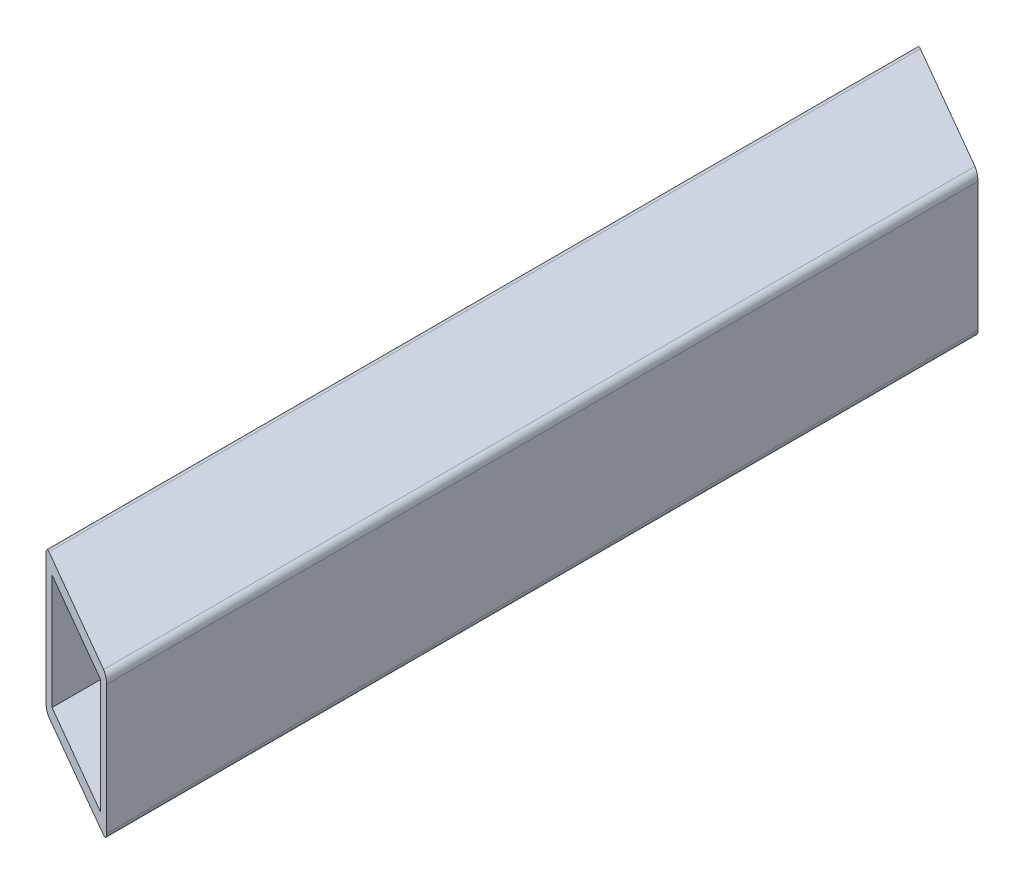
ISO-10303-21;
HEADER;
FILE_DESCRIPTION(('STEP AP214'),'2;1');
FILE_NAME('part.step','',(''),(''),'','','');
FILE_SCHEMA(('AUTOMOTIVE_DESIGN { 1 0 10303 214 1 1 1 1 }'));
ENDSEC;
DATA;
#1=APPLICATION_CONTEXT('core data for automotive mechanical design processes');
#2=APPLICATION_PROTOCOL_DEFINITION('international standard','automotive_design',2000,#1);
#3=PRODUCT_CONTEXT('',#1,'mechanical');
#4=PRODUCT('Part','Part','',(#3));
#5=PRODUCT_RELATED_PRODUCT_CATEGORY('part','',(#4));
#6=PRODUCT_DEFINITION_FORMATION('','',#4);
#7=PRODUCT_DEFINITION_CONTEXT('part definition',#1,'design');
#8=PRODUCT_DEFINITION('design','',#6,#7);
#9=PRODUCT_DEFINITION_SHAPE('','',#8);
#10=(LENGTH_UNIT() NAMED_UNIT(*) SI_UNIT(.MILLI.,.METRE.));
#11=(NAMED_UNIT(*) PLANE_ANGLE_UNIT() SI_UNIT($,.RADIAN.));
#12=(NAMED_UNIT(*) SI_UNIT($,.STERADIAN.) SOLID_ANGLE_UNIT());
#13=UNCERTAINTY_MEASURE_WITH_UNIT(LENGTH_MEASURE(1.E-05),#10,'distance_accuracy_value','');
#14=(GEOMETRIC_REPRESENTATION_CONTEXT(3) GLOBAL_UNCERTAINTY_ASSIGNED_CONTEXT((#13)) GLOBAL_UNIT_ASSIGNED_CONTEXT((#10,
#11,#12)) REPRESENTATION_CONTEXT('',''));
#15=CARTESIAN_POINT('',(0.,0.,0.));
#16=DIRECTION('',(0.,0.,1.));
#17=DIRECTION('',(1.,0.,0.));
#18=AXIS2_PLACEMENT_3D('',#15,#16,#17);
#19=CARTESIAN_POINT('',(-9.,8.,133.));
#20=DIRECTION('',(0.,1.,0.));
#21=DIRECTION('',(0.,0.,1.));
#22=AXIS2_PLACEMENT_3D('',#19,#20,#21);
#23=PLANE('',#22);
#24=DIRECTION('',(0.,0.,-1.));
#25=VECTOR('',#24,1.);
#26=CARTESIAN_POINT('',(8.,8.,133.));
#27=LINE('',#26,#25);
#28=CARTESIAN_POINT('',(8.,8.,131.845299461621));
#29=VERTEX_POINT('',#28);
#30=CARTESIAN_POINT('',(8.,8.,10.3923048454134));
#31=VERTEX_POINT('',#30);
#32=EDGE_CURVE('E210',#29,#31,#27,.T.);
#33=ORIENTED_EDGE('',*,*,#32,.F.);
#34=DIRECTION('',(-0.86602540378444,0.,-0.499999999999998));
#35=VECTOR('',#34,1.);
#36=CARTESIAN_POINT('',(-4.25000000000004,8.,124.772758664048));
#37=LINE('',#36,#35);
#38=CARTESIAN_POINT('',(-8.,8.,122.607695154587));
#39=VERTEX_POINT('',#38);
#40=EDGE_CURVE('E11',#29,#39,#37,.T.);
#41=ORIENTED_EDGE('',*,*,#40,.T.);
#42=DIRECTION('',(0.,0.,-1.));
#43=VECTOR('',#42,1.);
#44=CARTESIAN_POINT('',(-8.,8.,133.));
#45=LINE('',#44,#43);
#46=CARTESIAN_POINT('',(-8.,8.,1.15470053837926));
#47=VERTEX_POINT('',#46);
#48=EDGE_CURVE('E208',#39,#47,#45,.T.);
#49=ORIENTED_EDGE('',*,*,#48,.T.);
#50=DIRECTION('',(0.866025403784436,0.,0.500000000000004));
#51=VECTOR('',#50,1.);
#52=CARTESIAN_POINT('',(48.3406893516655,8.,33.6830127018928));
#53=LINE('',#52,#51);
#54=EDGE_CURVE('E38',#47,#31,#53,.T.);
#55=ORIENTED_EDGE('',*,*,#54,.T.);
#56=EDGE_LOOP('',(#33,#41,#49,#55));
#57=FACE_BOUND('',#56,.T.);
#58=ADVANCED_FACE('F30',(#57),#23,.F.);
#59=CARTESIAN_POINT('',(8.,-9.,133.));
#60=DIRECTION('',(-1.,0.,0.));
#61=DIRECTION('',(0.,-1.,0.));
#62=AXIS2_PLACEMENT_3D('',#59,#60,#61);
#63=PLANE('',#62);
#64=DIRECTION('',(0.,-1.,0.));
#65=VECTOR('',#64,1.);
#66=CARTESIAN_POINT('',(8.,-9.,131.845299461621));
#67=LINE('',#66,#65);
#68=CARTESIAN_POINT('',(8.,-8.,131.845299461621));
#69=VERTEX_POINT('',#68);
#70=EDGE_CURVE('E190',#29,#69,#67,.T.);
#71=ORIENTED_EDGE('',*,*,#70,.F.);
#72=ORIENTED_EDGE('',*,*,#32,.T.);
#73=DIRECTION('',(0.,1.,0.));
#74=VECTOR('',#73,1.);
#75=CARTESIAN_POINT('',(8.,-9.00000000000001,10.3923048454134));
#76=LINE('',#75,#74);
#77=CARTESIAN_POINT('',(8.,-8.,10.3923048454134));
#78=VERTEX_POINT('',#77);
#79=EDGE_CURVE('E227',#78,#31,#76,.T.);
#80=ORIENTED_EDGE('',*,*,#79,.F.);
#81=DIRECTION('',(0.,0.,-1.));
#82=VECTOR('',#81,1.);
#83=CARTESIAN_POINT('',(8.,-8.,133.));
#84=LINE('',#83,#82);
#85=EDGE_CURVE('E212',#69,#78,#84,.T.);
#86=ORIENTED_EDGE('',*,*,#85,.F.);
#87=EDGE_LOOP('',(#71,#72,#80,#86));
#88=FACE_BOUND('',#87,.T.);
#89=ADVANCED_FACE('F244',(#88),#63,.T.);
#90=CARTESIAN_POINT('',(-9.,-8.,133.));
#91=DIRECTION('',(0.,-1.,0.));
#92=DIRECTION('',(0.,0.,-1.));
#93=AXIS2_PLACEMENT_3D('',#90,#91,#92);
#94=PLANE('',#93);
#95=DIRECTION('',(0.,0.,-1.));
#96=VECTOR('',#95,1.);
#97=CARTESIAN_POINT('',(-8.,-8.,133.));
#98=LINE('',#97,#96);
#99=CARTESIAN_POINT('',(-8.,-8.,122.607695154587));
#100=VERTEX_POINT('',#99);
#101=CARTESIAN_POINT('',(-8.,-8.,1.15470053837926));
#102=VERTEX_POINT('',#101);
#103=EDGE_CURVE('E215',#100,#102,#98,.T.);
#104=ORIENTED_EDGE('',*,*,#103,.F.);
#105=DIRECTION('',(0.86602540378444,0.,0.499999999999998));
#106=VECTOR('',#105,1.);
#107=CARTESIAN_POINT('',(-4.25000000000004,-8.,124.772758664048));
#108=LINE('',#107,#106);
#109=EDGE_CURVE('E196',#100,#69,#108,.T.);
#110=ORIENTED_EDGE('',*,*,#109,.T.);
#111=ORIENTED_EDGE('',*,*,#85,.T.);
#112=DIRECTION('',(-0.866025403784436,0.,-0.500000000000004));
#113=VECTOR('',#112,1.);
#114=CARTESIAN_POINT('',(48.3406893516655,-8.,33.6830127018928));
#115=LINE('',#114,#113);
#116=EDGE_CURVE('E229',#78,#102,#115,.T.);
#117=ORIENTED_EDGE('',*,*,#116,.T.);
#118=EDGE_LOOP('',(#104,#110,#111,#117));
#119=FACE_BOUND('',#118,.T.);
#120=ADVANCED_FACE('F249',(#119),#94,.F.);
#121=CARTESIAN_POINT('',(-8.,-9.,133.));
#122=DIRECTION('',(1.,0.,0.));
#123=DIRECTION('',(0.,1.,0.));
#124=AXIS2_PLACEMENT_3D('',#121,#122,#123);
#125=PLANE('',#124);
#126=DIRECTION('',(0.,1.,0.));
#127=VECTOR('',#126,1.);
#128=CARTESIAN_POINT('',(-8.,-9.,122.607695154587));
#129=LINE('',#128,#127);
#130=EDGE_CURVE('E53',#100,#39,#129,.T.);
#131=ORIENTED_EDGE('',*,*,#130,.F.);
#132=ORIENTED_EDGE('',*,*,#103,.T.);
#133=DIRECTION('',(0.,-1.,0.));
#134=VECTOR('',#133,1.);
#135=CARTESIAN_POINT('',(-8.,-8.99999999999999,1.15470053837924));
#136=LINE('',#135,#134);
#137=EDGE_CURVE('E130',#47,#102,#136,.T.);
#138=ORIENTED_EDGE('',*,*,#137,.F.);
#139=ORIENTED_EDGE('',*,*,#48,.F.);
#140=EDGE_LOOP('',(#131,#132,#138,#139));
#141=FACE_BOUND('',#140,.T.);
#142=ADVANCED_FACE('F257',(#141),#125,.T.);
#143=CARTESIAN_POINT('',(-23.8618890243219,-10.,-8.00316535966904));
#144=DIRECTION('',(-0.500000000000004,0.,0.866025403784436));
#145=DIRECTION('',(0.866025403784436,0.,0.500000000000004));
#146=AXIS2_PLACEMENT_3D('',#143,#144,#145);
#147=PLANE('',#146);
#148=CARTESIAN_POINT('',(9.,-9.,10.969655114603));
#149=DIRECTION('',(-0.500000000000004,0.,0.866025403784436));
#150=DIRECTION('',(-0.866025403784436,0.,-0.500000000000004));
#151=AXIS2_PLACEMENT_3D('',#148,#149,#150);
#152=ELLIPSE('',#151,1.15470053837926,1.);
#153=CARTESIAN_POINT('',(10.,-9.,11.5470053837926));
#154=VERTEX_POINT('',#153);
#155=CARTESIAN_POINT('',(8.99999999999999,-10.,10.969655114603));
#156=VERTEX_POINT('',#155);
#157=EDGE_CURVE('E188',#154,#156,#152,.F.);
#158=ORIENTED_EDGE('',*,*,#157,.T.);
#159=DIRECTION('',(0.866025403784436,0.,0.500000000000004));
#160=VECTOR('',#159,1.);
#161=CARTESIAN_POINT('',(-23.8618890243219,-10.,-8.00316535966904));
#162=LINE('',#161,#160);
#163=CARTESIAN_POINT('',(-9.,-10.,0.57735026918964));
#164=VERTEX_POINT('',#163);
#165=EDGE_CURVE('E224',#164,#156,#162,.T.);
#166=ORIENTED_EDGE('',*,*,#165,.F.);
#167=CARTESIAN_POINT('',(-9.,-9.,0.577350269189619));
#168=DIRECTION('',(-0.500000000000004,0.,0.866025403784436));
#169=DIRECTION('',(-0.866025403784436,0.,-0.500000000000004));
#170=AXIS2_PLACEMENT_3D('',#167,#168,#169);
#171=ELLIPSE('',#170,1.15470053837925,0.999999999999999);
#172=CARTESIAN_POINT('',(-10.,-9.,0.));
#173=VERTEX_POINT('',#172);
#174=EDGE_CURVE('E129',#164,#173,#171,.F.);
#175=ORIENTED_EDGE('',*,*,#174,.T.);
#176=DIRECTION('',(0.,-1.,0.));
#177=VECTOR('',#176,1.);
#178=CARTESIAN_POINT('',(-10.,9.,0.));
#179=LINE('',#178,#177);
#180=CARTESIAN_POINT('',(-10.,9.,0.));
#181=VERTEX_POINT('',#180);
#182=EDGE_CURVE('E124',#181,#173,#179,.T.);
#183=ORIENTED_EDGE('',*,*,#182,.F.);
#184=CARTESIAN_POINT('',(-9.,9.,0.577350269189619));
#185=DIRECTION('',(-0.500000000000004,0.,0.866025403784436));
#186=DIRECTION('',(-0.866025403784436,0.,-0.500000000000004));
#187=AXIS2_PLACEMENT_3D('',#184,#185,#186);
#188=ELLIPSE('',#187,1.15470053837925,0.999999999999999);
#189=CARTESIAN_POINT('',(-9.,10.,0.57735026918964));
#190=VERTEX_POINT('',#189);
#191=EDGE_CURVE('E117',#181,#190,#188,.F.);
#192=ORIENTED_EDGE('',*,*,#191,.T.);
#193=DIRECTION('',(0.866025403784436,0.,0.500000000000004));
#194=VECTOR('',#193,1.);
#195=CARTESIAN_POINT('',(-23.8618890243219,10.,-8.00316535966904));
#196=LINE('',#195,#194);
#197=CARTESIAN_POINT('',(9.00000000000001,10.,10.969655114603));
#198=VERTEX_POINT('',#197);
#199=EDGE_CURVE('E121',#190,#198,#196,.T.);
#200=ORIENTED_EDGE('',*,*,#199,.T.);
#201=CARTESIAN_POINT('',(9.,9.,10.969655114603));
#202=DIRECTION('',(-0.500000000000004,0.,0.866025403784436));
#203=DIRECTION('',(-0.866025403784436,0.,-0.500000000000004));
#204=AXIS2_PLACEMENT_3D('',#201,#202,#203);
#205=ELLIPSE('',#204,1.15470053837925,0.999999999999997);
#206=CARTESIAN_POINT('',(10.,9.00000000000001,11.5470053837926));
#207=VERTEX_POINT('',#206);
#208=EDGE_CURVE('E179',#207,#198,#205,.T.);
#209=ORIENTED_EDGE('',*,*,#208,.F.);
#210=DIRECTION('',(0.,1.,0.));
#211=VECTOR('',#210,1.);
#212=CARTESIAN_POINT('',(10.,-9.00000000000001,11.5470053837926));
#213=LINE('',#212,#211);
#214=EDGE_CURVE('E185',#154,#207,#213,.T.);
#215=ORIENTED_EDGE('',*,*,#214,.F.);
#216=EDGE_LOOP('',(#158,#166,#175,#183,#192,#200,#209,#215));
#217=FACE_BOUND('',#216,.T.);
#218=ORIENTED_EDGE('',*,*,#137,.T.);
#219=ORIENTED_EDGE('',*,*,#116,.F.);
#220=ORIENTED_EDGE('',*,*,#79,.T.);
#221=ORIENTED_EDGE('',*,*,#54,.F.);
#222=EDGE_LOOP('',(#218,#219,#220,#221));
#223=FACE_BOUND('',#222,.T.);
#224=ADVANCED_FACE('F119',(#217,#223),#147,.F.);
#225=CARTESIAN_POINT('',(10.9728831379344,-10.,133.561694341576));
#226=DIRECTION('',(0.499999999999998,0.,-0.86602540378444));
#227=DIRECTION('',(-0.86602540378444,0.,-0.499999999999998));
#228=AXIS2_PLACEMENT_3D('',#225,#226,#227);
#229=PLANE('',#228);
#230=CARTESIAN_POINT('',(9.,-9.,132.42264973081));
#231=DIRECTION('',(0.499999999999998,0.,-0.86602540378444));
#232=DIRECTION('',(-0.86602540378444,0.,-0.499999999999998));
#233=AXIS2_PLACEMENT_3D('',#230,#231,#232);
#234=ELLIPSE('',#233,1.15470053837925,1.);
#235=CARTESIAN_POINT('',(9.,-10.,132.42264973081));
#236=VERTEX_POINT('',#235);
#237=CARTESIAN_POINT('',(10.,-9.,133.));
#238=VERTEX_POINT('',#237);
#239=EDGE_CURVE('E206',#236,#238,#234,.F.);
#240=ORIENTED_EDGE('',*,*,#239,.T.);
#241=DIRECTION('',(0.,1.,0.));
#242=VECTOR('',#241,1.);
#243=CARTESIAN_POINT('',(10.,-9.,133.));
#244=LINE('',#243,#242);
#245=CARTESIAN_POINT('',(10.,9.00000000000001,133.));
#246=VERTEX_POINT('',#245);
#247=EDGE_CURVE('E153',#238,#246,#244,.T.);
#248=ORIENTED_EDGE('',*,*,#247,.T.);
#249=CARTESIAN_POINT('',(9.,9.,132.42264973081));
#250=DIRECTION('',(0.499999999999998,0.,-0.86602540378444));
#251=DIRECTION('',(-0.86602540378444,0.,-0.499999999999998));
#252=AXIS2_PLACEMENT_3D('',#249,#250,#251);
#253=ELLIPSE('',#252,1.15470053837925,0.999999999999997);
#254=CARTESIAN_POINT('',(9.,10.,132.42264973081));
#255=VERTEX_POINT('',#254);
#256=EDGE_CURVE('E180',#255,#246,#253,.T.);
#257=ORIENTED_EDGE('',*,*,#256,.F.);
#258=DIRECTION('',(-0.86602540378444,0.,-0.499999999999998));
#259=VECTOR('',#258,1.);
#260=CARTESIAN_POINT('',(10.9728831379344,10.,133.561694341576));
#261=LINE('',#260,#259);
#262=CARTESIAN_POINT('',(-9.,10.,122.030344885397));
#263=VERTEX_POINT('',#262);
#264=EDGE_CURVE('E141',#255,#263,#261,.T.);
#265=ORIENTED_EDGE('',*,*,#264,.T.);
#266=CARTESIAN_POINT('',(-9.,9.,122.030344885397));
#267=DIRECTION('',(0.499999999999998,0.,-0.86602540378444));
#268=DIRECTION('',(-0.86602540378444,0.,-0.499999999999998));
#269=AXIS2_PLACEMENT_3D('',#266,#267,#268);
#270=ELLIPSE('',#269,1.15470053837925,0.999999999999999);
#271=CARTESIAN_POINT('',(-10.,9.,121.452994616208));
#272=VERTEX_POINT('',#271);
#273=EDGE_CURVE('E45',#263,#272,#270,.F.);
#274=ORIENTED_EDGE('',*,*,#273,.T.);
#275=DIRECTION('',(0.,1.,0.));
#276=VECTOR('',#275,1.);
#277=CARTESIAN_POINT('',(-10.,9.,121.452994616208));
#278=LINE('',#277,#276);
#279=CARTESIAN_POINT('',(-10.,-9.,121.452994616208));
#280=VERTEX_POINT('',#279);
#281=EDGE_CURVE('E200',#280,#272,#278,.T.);
#282=ORIENTED_EDGE('',*,*,#281,.F.);
#283=CARTESIAN_POINT('',(-9.,-9.,122.030344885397));
#284=DIRECTION('',(0.499999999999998,0.,-0.86602540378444));
#285=DIRECTION('',(-0.86602540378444,0.,-0.499999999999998));
#286=AXIS2_PLACEMENT_3D('',#283,#284,#285);
#287=ELLIPSE('',#286,1.15470053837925,0.999999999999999);
#288=CARTESIAN_POINT('',(-9.,-10.,122.030344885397));
#289=VERTEX_POINT('',#288);
#290=EDGE_CURVE('E203',#280,#289,#287,.F.);
#291=ORIENTED_EDGE('',*,*,#290,.T.);
#292=DIRECTION('',(-0.86602540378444,0.,-0.499999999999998));
#293=VECTOR('',#292,1.);
#294=CARTESIAN_POINT('',(10.9728831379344,-10.,133.561694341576));
#295=LINE('',#294,#293);
#296=EDGE_CURVE('E140',#236,#289,#295,.T.);
#297=ORIENTED_EDGE('',*,*,#296,.F.);
#298=EDGE_LOOP('',(#240,#248,#257,#265,#274,#282,#291,#297));
#299=FACE_BOUND('',#298,.T.);
#300=ORIENTED_EDGE('',*,*,#130,.T.);
#301=ORIENTED_EDGE('',*,*,#40,.F.);
#302=ORIENTED_EDGE('',*,*,#70,.T.);
#303=ORIENTED_EDGE('',*,*,#109,.F.);
#304=EDGE_LOOP('',(#300,#301,#302,#303));
#305=FACE_BOUND('',#304,.T.);
#306=ADVANCED_FACE('F219',(#299,#305),#229,.F.);
#307=CARTESIAN_POINT('',(-9.,-9.,133.));
#308=DIRECTION('',(0.,0.,-1.));
#309=DIRECTION('',(-1.,0.,0.));
#310=AXIS2_PLACEMENT_3D('',#307,#308,#309);
#311=CYLINDRICAL_SURFACE('',#310,0.999999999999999);
#312=ORIENTED_EDGE('',*,*,#290,.F.);
#313=DIRECTION('',(0.,0.,-1.));
#314=VECTOR('',#313,1.);
#315=CARTESIAN_POINT('',(-10.,-9.,133.));
#316=LINE('',#315,#314);
#317=EDGE_CURVE('E148',#280,#173,#316,.T.);
#318=ORIENTED_EDGE('',*,*,#317,.T.);
#319=ORIENTED_EDGE('',*,*,#174,.F.);
#320=DIRECTION('',(0.,0.,-1.));
#321=VECTOR('',#320,1.);
#322=CARTESIAN_POINT('',(-9.,-10.,133.));
#323=LINE('',#322,#321);
#324=EDGE_CURVE('E155',#289,#164,#323,.T.);
#325=ORIENTED_EDGE('',*,*,#324,.F.);
#326=EDGE_LOOP('',(#312,#318,#319,#325));
#327=FACE_BOUND('',#326,.T.);
#328=ADVANCED_FACE('F32',(#327),#311,.T.);
#329=CARTESIAN_POINT('',(9.,-10.,133.));
#330=DIRECTION('',(0.,-1.,0.));
#331=DIRECTION('',(0.,0.,-1.));
#332=AXIS2_PLACEMENT_3D('',#329,#330,#331);
#333=PLANE('',#332);
#334=ORIENTED_EDGE('',*,*,#296,.T.);
#335=ORIENTED_EDGE('',*,*,#324,.T.);
#336=ORIENTED_EDGE('',*,*,#165,.T.);
#337=DIRECTION('',(0.,0.,-1.));
#338=VECTOR('',#337,1.);
#339=CARTESIAN_POINT('',(9.,-10.,133.));
#340=LINE('',#339,#338);
#341=EDGE_CURVE('E161',#236,#156,#340,.T.);
#342=ORIENTED_EDGE('',*,*,#341,.F.);
#343=EDGE_LOOP('',(#334,#335,#336,#342));
#344=FACE_BOUND('',#343,.T.);
#345=ADVANCED_FACE('F226',(#344),#333,.T.);
#346=CARTESIAN_POINT('',(9.,-9.,133.));
#347=DIRECTION('',(0.,0.,-1.));
#348=DIRECTION('',(-1.,0.,0.));
#349=AXIS2_PLACEMENT_3D('',#346,#347,#348);
#350=CYLINDRICAL_SURFACE('',#349,1.);
#351=ORIENTED_EDGE('',*,*,#239,.F.);
#352=ORIENTED_EDGE('',*,*,#341,.T.);
#353=ORIENTED_EDGE('',*,*,#157,.F.);
#354=DIRECTION('',(0.,0.,-1.));
#355=VECTOR('',#354,1.);
#356=CARTESIAN_POINT('',(10.,-9.,133.));
#357=LINE('',#356,#355);
#358=EDGE_CURVE('E168',#238,#154,#357,.T.);
#359=ORIENTED_EDGE('',*,*,#358,.F.);
#360=EDGE_LOOP('',(#351,#352,#353,#359));
#361=FACE_BOUND('',#360,.T.);
#362=ADVANCED_FACE('F223',(#361),#350,.T.);
#363=CARTESIAN_POINT('',(10.,-9.,133.));
#364=DIRECTION('',(-1.,0.,0.));
#365=DIRECTION('',(0.,-1.,0.));
#366=AXIS2_PLACEMENT_3D('',#363,#364,#365);
#367=PLANE('',#366);
#368=ORIENTED_EDGE('',*,*,#358,.T.);
#369=ORIENTED_EDGE('',*,*,#214,.T.);
#370=DIRECTION('',(0.,0.,-1.));
#371=VECTOR('',#370,1.);
#372=CARTESIAN_POINT('',(10.,9.00000000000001,133.));
#373=LINE('',#372,#371);
#374=EDGE_CURVE('E146',#246,#207,#373,.T.);
#375=ORIENTED_EDGE('',*,*,#374,.F.);
#376=ORIENTED_EDGE('',*,*,#247,.F.);
#377=EDGE_LOOP('',(#368,#369,#375,#376));
#378=FACE_BOUND('',#377,.T.);
#379=ADVANCED_FACE('F184',(#378),#367,.F.);
#380=CARTESIAN_POINT('',(9.,9.,133.));
#381=DIRECTION('',(0.,0.,-1.));
#382=DIRECTION('',(-1.,0.,0.));
#383=AXIS2_PLACEMENT_3D('',#380,#381,#382);
#384=CYLINDRICAL_SURFACE('',#383,0.999999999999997);
#385=ORIENTED_EDGE('',*,*,#374,.T.);
#386=ORIENTED_EDGE('',*,*,#208,.T.);
#387=DIRECTION('',(0.,0.,-1.));
#388=VECTOR('',#387,1.);
#389=CARTESIAN_POINT('',(9.,10.,133.));
#390=LINE('',#389,#388);
#391=EDGE_CURVE('E139',#255,#198,#390,.T.);
#392=ORIENTED_EDGE('',*,*,#391,.F.);
#393=ORIENTED_EDGE('',*,*,#256,.T.);
#394=EDGE_LOOP('',(#385,#386,#392,#393));
#395=FACE_BOUND('',#394,.T.);
#396=ADVANCED_FACE('F178',(#395),#384,.T.);
#397=CARTESIAN_POINT('',(-9.,10.,133.));
#398=DIRECTION('',(0.,1.,0.));
#399=DIRECTION('',(0.,0.,1.));
#400=AXIS2_PLACEMENT_3D('',#397,#398,#399);
#401=PLANE('',#400);
#402=ORIENTED_EDGE('',*,*,#264,.F.);
#403=ORIENTED_EDGE('',*,*,#391,.T.);
#404=ORIENTED_EDGE('',*,*,#199,.F.);
#405=DIRECTION('',(0.,0.,-1.));
#406=VECTOR('',#405,1.);
#407=CARTESIAN_POINT('',(-9.,10.,133.));
#408=LINE('',#407,#406);
#409=EDGE_CURVE('E137',#263,#190,#408,.T.);
#410=ORIENTED_EDGE('',*,*,#409,.F.);
#411=EDGE_LOOP('',(#402,#403,#404,#410));
#412=FACE_BOUND('',#411,.T.);
#413=ADVANCED_FACE('F136',(#412),#401,.T.);
#414=CARTESIAN_POINT('',(-9.,9.,133.));
#415=DIRECTION('',(0.,0.,-1.));
#416=DIRECTION('',(-1.,0.,0.));
#417=AXIS2_PLACEMENT_3D('',#414,#415,#416);
#418=CYLINDRICAL_SURFACE('',#417,0.999999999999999);
#419=ORIENTED_EDGE('',*,*,#273,.F.);
#420=ORIENTED_EDGE('',*,*,#409,.T.);
#421=ORIENTED_EDGE('',*,*,#191,.F.);
#422=DIRECTION('',(0.,0.,-1.));
#423=VECTOR('',#422,1.);
#424=CARTESIAN_POINT('',(-10.,9.,133.));
#425=LINE('',#424,#423);
#426=EDGE_CURVE('E144',#272,#181,#425,.T.);
#427=ORIENTED_EDGE('',*,*,#426,.F.);
#428=EDGE_LOOP('',(#419,#420,#421,#427));
#429=FACE_BOUND('',#428,.T.);
#430=ADVANCED_FACE('F143',(#429),#418,.T.);
#431=CARTESIAN_POINT('',(-10.,9.,133.));
#432=DIRECTION('',(1.,0.,0.));
#433=DIRECTION('',(0.,1.,0.));
#434=AXIS2_PLACEMENT_3D('',#431,#432,#433);
#435=PLANE('',#434);
#436=ORIENTED_EDGE('',*,*,#317,.F.);
#437=ORIENTED_EDGE('',*,*,#281,.T.);
#438=ORIENTED_EDGE('',*,*,#426,.T.);
#439=ORIENTED_EDGE('',*,*,#182,.T.);
#440=EDGE_LOOP('',(#436,#437,#438,#439));
#441=FACE_BOUND('',#440,.T.);
#442=ADVANCED_FACE('F237',(#441),#435,.F.);
#443=CLOSED_SHELL('',(#58,#89,#120,#142,#224,#306,#328,#345,#362,#379,#396,#413,#430,#442));
#444=MANIFOLD_SOLID_BREP('B2',#443);
#445=ADVANCED_BREP_SHAPE_REPRESENTATION('',(#18,#444),#14);
#446=SHAPE_DEFINITION_REPRESENTATION(#9,#445);
ENDSEC;
END-ISO-10303-21;
